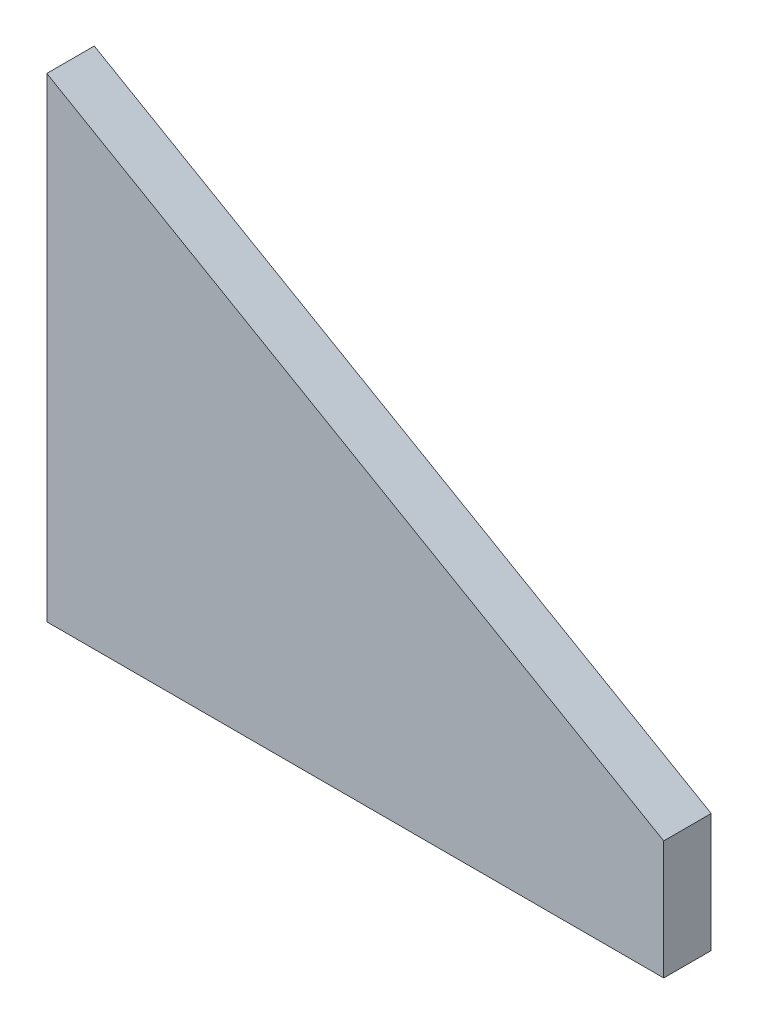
ISO-10303-21;
HEADER;
FILE_DESCRIPTION(('STEP AP214'),'2;1');
FILE_NAME('part.step','',(''),(''),'','','');
FILE_SCHEMA(('AUTOMOTIVE_DESIGN { 1 0 10303 214 1 1 1 1 }'));
ENDSEC;
DATA;
#1=APPLICATION_CONTEXT('core data for automotive mechanical design processes');
#2=APPLICATION_PROTOCOL_DEFINITION('international standard','automotive_design',2000,#1);
#3=PRODUCT_CONTEXT('',#1,'mechanical');
#4=PRODUCT('Part','Part','',(#3));
#5=PRODUCT_RELATED_PRODUCT_CATEGORY('part','',(#4));
#6=PRODUCT_DEFINITION_FORMATION('','',#4);
#7=PRODUCT_DEFINITION_CONTEXT('part definition',#1,'design');
#8=PRODUCT_DEFINITION('design','',#6,#7);
#9=PRODUCT_DEFINITION_SHAPE('','',#8);
#10=(LENGTH_UNIT() NAMED_UNIT(*) SI_UNIT(.MILLI.,.METRE.));
#11=(NAMED_UNIT(*) PLANE_ANGLE_UNIT() SI_UNIT($,.RADIAN.));
#12=(NAMED_UNIT(*) SI_UNIT($,.STERADIAN.) SOLID_ANGLE_UNIT());
#13=UNCERTAINTY_MEASURE_WITH_UNIT(LENGTH_MEASURE(1.E-05),#10,'distance_accuracy_value','');
#14=(GEOMETRIC_REPRESENTATION_CONTEXT(3) GLOBAL_UNCERTAINTY_ASSIGNED_CONTEXT((#13)) GLOBAL_UNIT_ASSIGNED_CONTEXT((#10,
#11,#12)) REPRESENTATION_CONTEXT('',''));
#15=CARTESIAN_POINT('',(0.,0.,0.));
#16=DIRECTION('',(0.,0.,1.));
#17=DIRECTION('',(1.,0.,0.));
#18=AXIS2_PLACEMENT_3D('',#15,#16,#17);
#19=CARTESIAN_POINT('',(0.,50.,20.));
#20=DIRECTION('',(-1.,0.,0.));
#21=DIRECTION('',(0.,-1.,0.));
#22=AXIS2_PLACEMENT_3D('',#19,#20,#21);
#23=PLANE('',#22);
#24=DIRECTION('',(0.,1.,0.));
#25=VECTOR('',#24,1.);
#26=CARTESIAN_POINT('',(0.,50.,0.));
#27=LINE('',#26,#25);
#28=CARTESIAN_POINT('',(0.,0.,0.));
#29=VERTEX_POINT('',#28);
#30=CARTESIAN_POINT('',(0.,50.,0.));
#31=VERTEX_POINT('',#30);
#32=EDGE_CURVE('E96',#29,#31,#27,.T.);
#33=ORIENTED_EDGE('',*,*,#32,.T.);
#34=DIRECTION('',(0.,0.,-1.));
#35=VECTOR('',#34,1.);
#36=CARTESIAN_POINT('',(0.,50.,20.));
#37=LINE('',#36,#35);
#38=CARTESIAN_POINT('',(0.,50.,20.));
#39=VERTEX_POINT('',#38);
#40=EDGE_CURVE('E11',#39,#31,#37,.T.);
#41=ORIENTED_EDGE('',*,*,#40,.F.);
#42=DIRECTION('',(0.,1.,0.));
#43=VECTOR('',#42,1.);
#44=CARTESIAN_POINT('',(0.,50.,20.));
#45=LINE('',#44,#43);
#46=CARTESIAN_POINT('',(0.,0.,20.));
#47=VERTEX_POINT('',#46);
#48=EDGE_CURVE('E84',#47,#39,#45,.T.);
#49=ORIENTED_EDGE('',*,*,#48,.F.);
#50=DIRECTION('',(0.,0.,-1.));
#51=VECTOR('',#50,1.);
#52=CARTESIAN_POINT('',(0.,0.,20.));
#53=LINE('',#52,#51);
#54=EDGE_CURVE('E92',#47,#29,#53,.T.);
#55=ORIENTED_EDGE('',*,*,#54,.T.);
#56=EDGE_LOOP('',(#33,#41,#49,#55));
#57=FACE_BOUND('',#56,.T.);
#58=ADVANCED_FACE('F33',(#57),#23,.F.);
#59=CARTESIAN_POINT('',(-259.807621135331,200.000000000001,20.));
#60=DIRECTION('',(-0.500000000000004,-0.866025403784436,0.));
#61=DIRECTION('',(0.866025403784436,-0.500000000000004,0.));
#62=AXIS2_PLACEMENT_3D('',#59,#60,#61);
#63=PLANE('',#62);
#64=DIRECTION('',(-0.866025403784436,0.500000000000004,0.));
#65=VECTOR('',#64,1.);
#66=CARTESIAN_POINT('',(-259.807621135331,200.000000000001,0.));
#67=LINE('',#66,#65);
#68=CARTESIAN_POINT('',(-259.807621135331,200.000000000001,0.));
#69=VERTEX_POINT('',#68);
#70=EDGE_CURVE('E88',#31,#69,#67,.T.);
#71=ORIENTED_EDGE('',*,*,#70,.T.);
#72=DIRECTION('',(0.,0.,-1.));
#73=VECTOR('',#72,1.);
#74=CARTESIAN_POINT('',(-259.807621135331,200.000000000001,20.));
#75=LINE('',#74,#73);
#76=CARTESIAN_POINT('',(-259.807621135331,200.000000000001,20.));
#77=VERTEX_POINT('',#76);
#78=EDGE_CURVE('E41',#77,#69,#75,.T.);
#79=ORIENTED_EDGE('',*,*,#78,.F.);
#80=DIRECTION('',(-0.866025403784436,0.500000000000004,0.));
#81=VECTOR('',#80,1.);
#82=CARTESIAN_POINT('',(-259.807621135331,200.000000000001,20.));
#83=LINE('',#82,#81);
#84=EDGE_CURVE('E79',#39,#77,#83,.T.);
#85=ORIENTED_EDGE('',*,*,#84,.F.);
#86=ORIENTED_EDGE('',*,*,#40,.T.);
#87=EDGE_LOOP('',(#71,#79,#85,#86));
#88=FACE_BOUND('',#87,.T.);
#89=ADVANCED_FACE('F87',(#88),#63,.F.);
#90=CARTESIAN_POINT('',(-259.807621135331,0.,20.));
#91=DIRECTION('',(1.,0.,0.));
#92=DIRECTION('',(0.,1.,0.));
#93=AXIS2_PLACEMENT_3D('',#90,#91,#92);
#94=PLANE('',#93);
#95=DIRECTION('',(0.,-1.,0.));
#96=VECTOR('',#95,1.);
#97=CARTESIAN_POINT('',(-259.807621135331,0.,0.));
#98=LINE('',#97,#96);
#99=CARTESIAN_POINT('',(-259.807621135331,0.,0.));
#100=VERTEX_POINT('',#99);
#101=EDGE_CURVE('E66',#69,#100,#98,.T.);
#102=ORIENTED_EDGE('',*,*,#101,.T.);
#103=DIRECTION('',(0.,0.,-1.));
#104=VECTOR('',#103,1.);
#105=CARTESIAN_POINT('',(-259.807621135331,0.,20.));
#106=LINE('',#105,#104);
#107=CARTESIAN_POINT('',(-259.807621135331,0.,20.));
#108=VERTEX_POINT('',#107);
#109=EDGE_CURVE('E89',#108,#100,#106,.T.);
#110=ORIENTED_EDGE('',*,*,#109,.F.);
#111=DIRECTION('',(0.,-1.,0.));
#112=VECTOR('',#111,1.);
#113=CARTESIAN_POINT('',(-259.807621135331,0.,20.));
#114=LINE('',#113,#112);
#115=EDGE_CURVE('E82',#77,#108,#114,.T.);
#116=ORIENTED_EDGE('',*,*,#115,.F.);
#117=ORIENTED_EDGE('',*,*,#78,.T.);
#118=EDGE_LOOP('',(#102,#110,#116,#117));
#119=FACE_BOUND('',#118,.T.);
#120=ADVANCED_FACE('F90',(#119),#94,.F.);
#121=CARTESIAN_POINT('',(0.,0.,20.));
#122=DIRECTION('',(0.,1.,0.));
#123=DIRECTION('',(-1.,0.,0.));
#124=AXIS2_PLACEMENT_3D('',#121,#122,#123);
#125=PLANE('',#124);
#126=DIRECTION('',(1.,0.,0.));
#127=VECTOR('',#126,1.);
#128=CARTESIAN_POINT('',(0.,0.,0.));
#129=LINE('',#128,#127);
#130=EDGE_CURVE('E72',#100,#29,#129,.T.);
#131=ORIENTED_EDGE('',*,*,#130,.T.);
#132=ORIENTED_EDGE('',*,*,#54,.F.);
#133=DIRECTION('',(1.,0.,0.));
#134=VECTOR('',#133,1.);
#135=CARTESIAN_POINT('',(0.,0.,20.));
#136=LINE('',#135,#134);
#137=EDGE_CURVE('E49',#108,#47,#136,.T.);
#138=ORIENTED_EDGE('',*,*,#137,.F.);
#139=ORIENTED_EDGE('',*,*,#109,.T.);
#140=EDGE_LOOP('',(#131,#132,#138,#139));
#141=FACE_BOUND('',#140,.T.);
#142=ADVANCED_FACE('F103',(#141),#125,.F.);
#143=CARTESIAN_POINT('',(0.,0.,20.));
#144=DIRECTION('',(0.,0.,-1.));
#145=DIRECTION('',(-1.,0.,0.));
#146=AXIS2_PLACEMENT_3D('',#143,#144,#145);
#147=PLANE('',#146);
#148=ORIENTED_EDGE('',*,*,#48,.T.);
#149=ORIENTED_EDGE('',*,*,#84,.T.);
#150=ORIENTED_EDGE('',*,*,#115,.T.);
#151=ORIENTED_EDGE('',*,*,#137,.T.);
#152=EDGE_LOOP('',(#148,#149,#150,#151));
#153=FACE_BOUND('',#152,.T.);
#154=ADVANCED_FACE('F80',(#153),#147,.F.);
#155=CARTESIAN_POINT('',(0.,0.,0.));
#156=DIRECTION('',(0.,0.,-1.));
#157=DIRECTION('',(-1.,0.,0.));
#158=AXIS2_PLACEMENT_3D('',#155,#156,#157);
#159=PLANE('',#158);
#160=ORIENTED_EDGE('',*,*,#32,.F.);
#161=ORIENTED_EDGE('',*,*,#130,.F.);
#162=ORIENTED_EDGE('',*,*,#101,.F.);
#163=ORIENTED_EDGE('',*,*,#70,.F.);
#164=EDGE_LOOP('',(#160,#161,#162,#163));
#165=FACE_BOUND('',#164,.T.);
#166=ADVANCED_FACE('F106',(#165),#159,.T.);
#167=CLOSED_SHELL('',(#58,#89,#120,#142,#154,#166));
#168=MANIFOLD_SOLID_BREP('B2',#167);
#169=ADVANCED_BREP_SHAPE_REPRESENTATION('',(#18,#168),#14);
#170=SHAPE_DEFINITION_REPRESENTATION(#9,#169);
ENDSEC;
END-ISO-10303-21;
